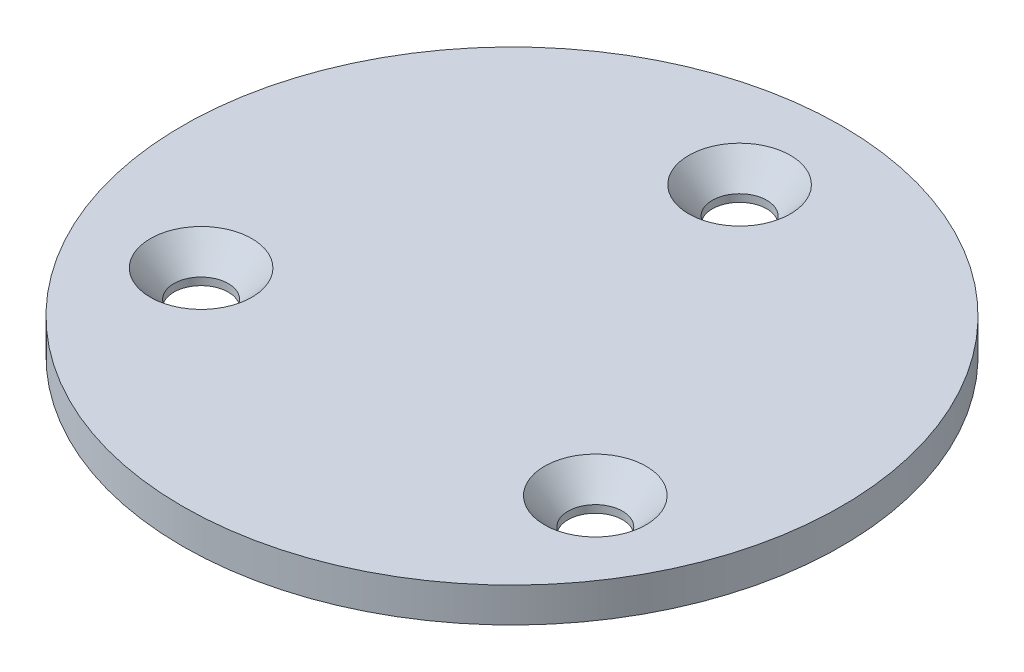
from build123d import *

# Parameters (mm, degrees)
SKETCH1_R         = 22.987
EXTRUDE1_DEPTH    = 1.2065
CIRPATTERN1_COUNT = 3


with BuildPart() as part:
    # Sketch1 → Extrude1 (new, symmetric)
    with BuildSketch(Plane(origin=(0, 0, 0), x_dir=(1, 0, 0), z_dir=(0, 1, 0))):
        with Locations(Location((0, 0, 0), (0, 0, 270))):
            Circle(SKETCH1_R)
    extrude(amount=EXTRUDE1_DEPTH, both=True)

    # Sketch3 → CSK for _6 Flat Head Machine Screw2 (revolve, cut)
    with BuildSketch(Plane(origin=(0, 1.2065, -15.875), x_dir=(0, 0, 1), z_dir=(1, 0, 0))):
        Polygon((0, 0), (0, 2.413), (1.89865, 2.413), (1.89865, 1.891953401), (3.5433, 0), align=None)
    csk_for_6_flat_head_machine_screw2 = revolve(axis=Axis((0, 7.5565, -15.875), (0, -1, 0)), mode=Mode.SUBTRACT)

    # CirPattern1: CSK for _6 Flat Head Machine Screw2 ×3 about axis
    cirpattern1_axis = Axis((0, 0, 0), (0, 1, 0))
    for i in range(1, CIRPATTERN1_COUNT):
        add(csk_for_6_flat_head_machine_screw2.rotate(cirpattern1_axis, i * 360 / CIRPATTERN1_COUNT), mode=Mode.SUBTRACT)


solid = part.part
